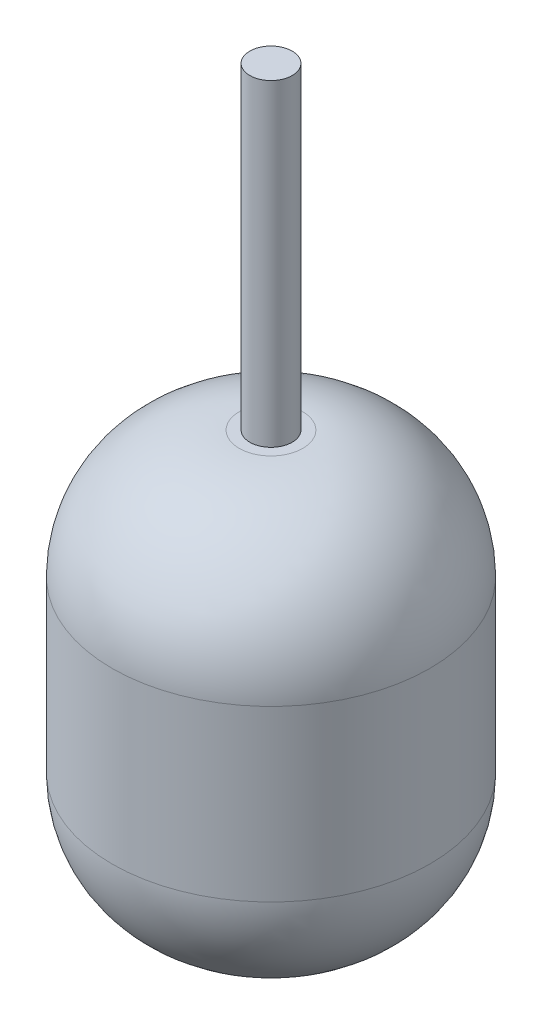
ISO-10303-21;
HEADER;
FILE_DESCRIPTION(('STEP AP214'),'2;1');
FILE_NAME('part.step','',(''),(''),'','','');
FILE_SCHEMA(('AUTOMOTIVE_DESIGN { 1 0 10303 214 1 1 1 1 }'));
ENDSEC;
DATA;
#1=APPLICATION_CONTEXT('core data for automotive mechanical design processes');
#2=APPLICATION_PROTOCOL_DEFINITION('international standard','automotive_design',2000,#1);
#3=PRODUCT_CONTEXT('',#1,'mechanical');
#4=PRODUCT('Part','Part','',(#3));
#5=PRODUCT_RELATED_PRODUCT_CATEGORY('part','',(#4));
#6=PRODUCT_DEFINITION_FORMATION('','',#4);
#7=PRODUCT_DEFINITION_CONTEXT('part definition',#1,'design');
#8=PRODUCT_DEFINITION('design','',#6,#7);
#9=PRODUCT_DEFINITION_SHAPE('','',#8);
#10=(LENGTH_UNIT() NAMED_UNIT(*) SI_UNIT(.MILLI.,.METRE.));
#11=(NAMED_UNIT(*) PLANE_ANGLE_UNIT() SI_UNIT($,.RADIAN.));
#12=(NAMED_UNIT(*) SI_UNIT($,.STERADIAN.) SOLID_ANGLE_UNIT());
#13=UNCERTAINTY_MEASURE_WITH_UNIT(LENGTH_MEASURE(1.E-05),#10,'distance_accuracy_value','');
#14=(GEOMETRIC_REPRESENTATION_CONTEXT(3) GLOBAL_UNCERTAINTY_ASSIGNED_CONTEXT((#13)) GLOBAL_UNIT_ASSIGNED_CONTEXT((#10,
#11,#12)) REPRESENTATION_CONTEXT('',''));
#15=CARTESIAN_POINT('',(0.,0.,0.));
#16=DIRECTION('',(0.,0.,1.));
#17=DIRECTION('',(1.,0.,0.));
#18=AXIS2_PLACEMENT_3D('',#15,#16,#17);
#19=CARTESIAN_POINT('',(0.,40.,0.));
#20=DIRECTION('',(0.,-1.,0.));
#21=DIRECTION('',(0.,0.,-1.));
#22=AXIS2_PLACEMENT_3D('',#19,#20,#21);
#23=CYLINDRICAL_SURFACE('',#22,15.);
#24=CARTESIAN_POINT('',(0.,28.,0.));
#25=DIRECTION('',(0.,1.,0.));
#26=DIRECTION('',(0.,0.,1.));
#27=AXIS2_PLACEMENT_3D('',#24,#25,#26);
#28=CIRCLE('',#27,15.);
#29=CARTESIAN_POINT('',(0.,28.,15.));
#30=VERTEX_POINT('',#29);
#31=EDGE_CURVE('E52',#30,#30,#28,.F.);
#32=ORIENTED_EDGE('',*,*,#31,.T.);
#33=EDGE_LOOP('',(#32));
#34=FACE_BOUND('',#33,.T.);
#35=CARTESIAN_POINT('',(0.,12.,0.));
#36=DIRECTION('',(0.,1.,0.));
#37=DIRECTION('',(0.,0.,1.));
#38=AXIS2_PLACEMENT_3D('',#35,#36,#37);
#39=CIRCLE('',#38,15.);
#40=CARTESIAN_POINT('',(0.,12.,15.));
#41=VERTEX_POINT('',#40);
#42=EDGE_CURVE('E56',#41,#41,#39,.T.);
#43=ORIENTED_EDGE('',*,*,#42,.T.);
#44=EDGE_LOOP('',(#43));
#45=FACE_BOUND('',#44,.T.);
#46=ADVANCED_FACE('F45',(#34,#45),#23,.T.);
#47=CARTESIAN_POINT('',(0.,40.,0.));
#48=DIRECTION('',(0.,1.,0.));
#49=DIRECTION('',(0.,0.,1.));
#50=AXIS2_PLACEMENT_3D('',#47,#48,#49);
#51=PLANE('',#50);
#52=CARTESIAN_POINT('',(0.,40.,0.));
#53=DIRECTION('',(0.,1.,0.));
#54=DIRECTION('',(0.,0.,1.));
#55=AXIS2_PLACEMENT_3D('',#52,#53,#54);
#56=CIRCLE('',#55,2.);
#57=CARTESIAN_POINT('',(0.,40.,2.));
#58=VERTEX_POINT('',#57);
#59=EDGE_CURVE('E66',#58,#58,#56,.T.);
#60=ORIENTED_EDGE('',*,*,#59,.F.);
#61=EDGE_LOOP('',(#60));
#62=FACE_BOUND('',#61,.T.);
#63=CARTESIAN_POINT('',(0.,40.,0.));
#64=DIRECTION('',(0.,1.,0.));
#65=DIRECTION('',(0.,0.,1.));
#66=AXIS2_PLACEMENT_3D('',#63,#64,#65);
#67=CIRCLE('',#66,3.);
#68=CARTESIAN_POINT('',(0.,40.,3.));
#69=VERTEX_POINT('',#68);
#70=EDGE_CURVE('E60',#69,#69,#67,.T.);
#71=ORIENTED_EDGE('',*,*,#70,.T.);
#72=EDGE_LOOP('',(#71));
#73=FACE_BOUND('',#72,.T.);
#74=ADVANCED_FACE('F80',(#62,#73),#51,.T.);
#75=CARTESIAN_POINT('',(0.,0.,0.));
#76=DIRECTION('',(0.,1.,0.));
#77=DIRECTION('',(0.,0.,1.));
#78=AXIS2_PLACEMENT_3D('',#75,#76,#77);
#79=PLANE('',#78);
#80=CARTESIAN_POINT('',(0.,0.,0.));
#81=DIRECTION('',(0.,1.,0.));
#82=DIRECTION('',(0.,0.,1.));
#83=AXIS2_PLACEMENT_3D('',#80,#81,#82);
#84=CIRCLE('',#83,3.);
#85=CARTESIAN_POINT('',(0.,0.,3.));
#86=VERTEX_POINT('',#85);
#87=EDGE_CURVE('E10',#86,#86,#84,.F.);
#88=ORIENTED_EDGE('',*,*,#87,.T.);
#89=EDGE_LOOP('',(#88));
#90=FACE_BOUND('',#89,.T.);
#91=ADVANCED_FACE('F83',(#90),#79,.F.);
#92=CARTESIAN_POINT('',(0.,28.,0.));
#93=DIRECTION('',(0.,1.,0.));
#94=DIRECTION('',(0.,0.,1.));
#95=AXIS2_PLACEMENT_3D('',#92,#93,#94);
#96=DEGENERATE_TOROIDAL_SURFACE('',#95,3.,12.,.T.);
#97=ORIENTED_EDGE('',*,*,#31,.F.);
#98=EDGE_LOOP('',(#97));
#99=FACE_BOUND('',#98,.T.);
#100=ORIENTED_EDGE('',*,*,#70,.F.);
#101=EDGE_LOOP('',(#100));
#102=FACE_BOUND('',#101,.T.);
#103=ADVANCED_FACE('F87',(#99,#102),#96,.T.);
#104=CARTESIAN_POINT('',(0.,12.,0.));
#105=DIRECTION('',(0.,1.,0.));
#106=DIRECTION('',(0.,0.,1.));
#107=AXIS2_PLACEMENT_3D('',#104,#105,#106);
#108=DEGENERATE_TOROIDAL_SURFACE('',#107,3.,12.,.T.);
#109=ORIENTED_EDGE('',*,*,#87,.F.);
#110=EDGE_LOOP('',(#109));
#111=FACE_BOUND('',#110,.T.);
#112=ORIENTED_EDGE('',*,*,#42,.F.);
#113=EDGE_LOOP('',(#112));
#114=FACE_BOUND('',#113,.T.);
#115=ADVANCED_FACE('F47',(#111,#114),#108,.T.);
#116=CARTESIAN_POINT('',(0.,70.,0.));
#117=DIRECTION('',(0.,-1.,0.));
#118=DIRECTION('',(0.,0.,-1.));
#119=AXIS2_PLACEMENT_3D('',#116,#117,#118);
#120=CYLINDRICAL_SURFACE('',#119,2.);
#121=CARTESIAN_POINT('',(0.,70.,0.));
#122=DIRECTION('',(0.,1.,0.));
#123=DIRECTION('',(0.,0.,1.));
#124=AXIS2_PLACEMENT_3D('',#121,#122,#123);
#125=CIRCLE('',#124,2.);
#126=CARTESIAN_POINT('',(0.,70.,2.));
#127=VERTEX_POINT('',#126);
#128=EDGE_CURVE('E65',#127,#127,#125,.T.);
#129=ORIENTED_EDGE('',*,*,#128,.F.);
#130=EDGE_LOOP('',(#129));
#131=FACE_BOUND('',#130,.T.);
#132=ORIENTED_EDGE('',*,*,#59,.T.);
#133=EDGE_LOOP('',(#132));
#134=FACE_BOUND('',#133,.T.);
#135=ADVANCED_FACE('F74',(#131,#134),#120,.T.);
#136=CARTESIAN_POINT('',(0.,70.,0.));
#137=DIRECTION('',(0.,1.,0.));
#138=DIRECTION('',(0.,0.,1.));
#139=AXIS2_PLACEMENT_3D('',#136,#137,#138);
#140=PLANE('',#139);
#141=ORIENTED_EDGE('',*,*,#128,.T.);
#142=EDGE_LOOP('',(#141));
#143=FACE_BOUND('',#142,.T.);
#144=ADVANCED_FACE('F72',(#143),#140,.T.);
#145=CLOSED_SHELL('',(#46,#74,#91,#103,#115,#135,#144));
#146=MANIFOLD_SOLID_BREP('B2',#145);
#147=ADVANCED_BREP_SHAPE_REPRESENTATION('',(#18,#146),#14);
#148=SHAPE_DEFINITION_REPRESENTATION(#9,#147);
ENDSEC;
END-ISO-10303-21;
